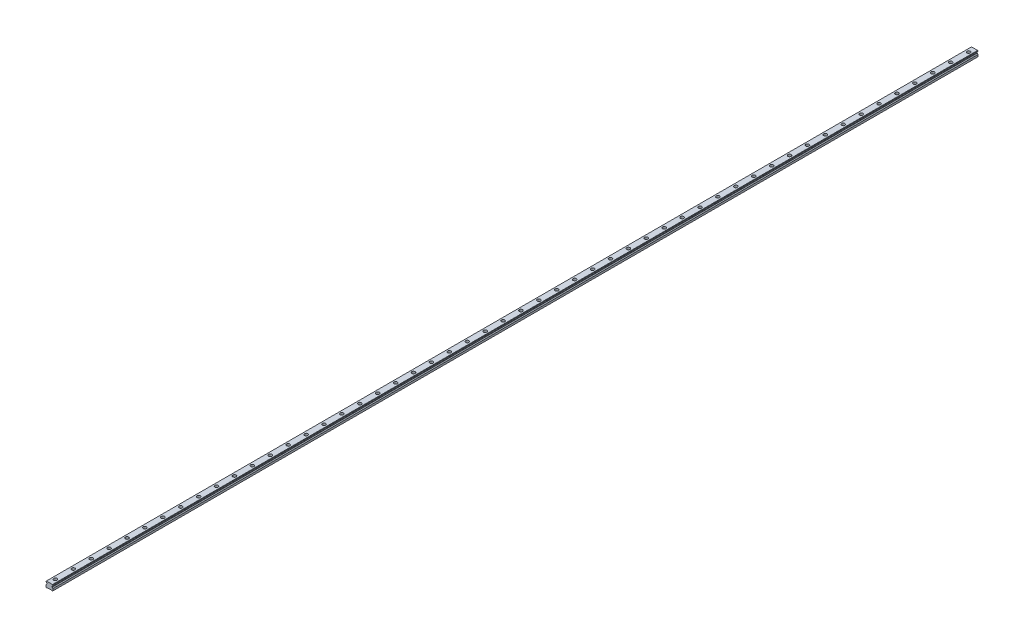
from build123d import *

# Parameters (mm, degrees)
SKETCH1_W           = 23
SKETCH1_H           = 19.2
BOSS_EXTRUDE1_DEPTH = 1550
CUT_EXTRUDE1_DEPTH  = 3101.080787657
CHAMFER1_SIZE       = 1.25
FILLET1_R           = 1.25
CUT_EXTRUDE2_DEPTH  = 3101.080787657
SKETCH4_R           = 5.5
SKETCH4_R_2         = 3.5
CUT_EXTRUDE3_DEPTH  = 9
SKETCH4_2_R         = 3.5
CUT_EXTRUDE4_DEPTH  = 1551.161568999
LPATTERN1_COUNT     = 52
LPATTERN1_PITCH     = 60


with BuildPart() as part:
    # Sketch1 → Boss-Extrude1 (new, symmetric)
    with BuildSketch(Plane.XY):
        with Locations((0, 9.6)):
            Rectangle(SKETCH1_W, SKETCH1_H)
    extrude(amount=BOSS_EXTRUDE1_DEPTH, both=True)

    # Sketch2 → Cut-Extrude1 (cut, through all)
    with BuildSketch(Plane.XY.offset(1550)):
        Polygon((-11.5, 16.7), (-11.5, 7.95), (-8.583333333, 10.866666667), (-8.583333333, 13.783333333), align=None)
        Polygon((8.583333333, 13.783333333), (11.5, 16.7), (11.5, 7.95), (8.583333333, 10.866666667), align=None)
    extrude(amount=-CUT_EXTRUDE1_DEPTH, mode=Mode.SUBTRACT)

    # Chamfer1
    chamfer1_edges = [part.edges().sort_by_distance(p)[0] for p in [
        (-11.5, 19.2, 0),
        (11.5, 19.2, 0),
        (11.5, 0, 0),
        (-11.5, 0, 0),
    ]]
    chamfer(chamfer1_edges, length=CHAMFER1_SIZE)

    # Fillet1
    fillet1_edges = [part.edges().sort_by_distance(p)[0] for p in [
        (-8.583333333, 13.783333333, 0),
        (-8.583333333, 10.866666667, 0),
        (8.583333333, 10.866666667, 0),
        (8.583333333, 13.783333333, 0),
    ]]
    fillet(fillet1_edges, radius=FILLET1_R)

    # Sketch3 → Cut-Extrude2 (cut, through all)
    with BuildSketch(Plane.XY.offset(1550)):
        Polygon((-7, 0), (-5.75, 1.25), (5.75, 1.25), (7, 0), align=None)
    extrude(amount=-CUT_EXTRUDE2_DEPTH, mode=Mode.SUBTRACT)

    # Sketch4 → Cut-Extrude3 (cut)
    with BuildSketch(Plane(origin=(0, 19.2, 0), x_dir=(1, 0, 0), z_dir=(0, 1, 0))):
        with Locations(Location((0, -1530, 0), (0, 0, 270))):
            Circle(SKETCH4_R)
        with Locations(Location((0, -1530, 0), (0, 0, 270))):
            Circle(SKETCH4_R_2, mode=Mode.SUBTRACT)
    cut_extrude3 = extrude(amount=-CUT_EXTRUDE3_DEPTH, mode=Mode.SUBTRACT)

    # Sketch4_2 → Cut-Extrude4 (cut, through all)
    with BuildSketch(Plane(origin=(0, 19.2, 0), x_dir=(1, 0, 0), z_dir=(0, 1, 0))):
        with Locations(Location((0, -1530, 0), (0, 0, 270))):
            Circle(SKETCH4_2_R)
    cut_extrude4 = extrude(amount=-CUT_EXTRUDE4_DEPTH, mode=Mode.SUBTRACT)

    # LPattern1: Cut-Extrude3, Cut-Extrude4 ×52
    with Locations(*[(0, 0, -i * LPATTERN1_PITCH) for i in range(1, LPATTERN1_COUNT)]):
        add(cut_extrude3, mode=Mode.SUBTRACT)
        add(cut_extrude4, mode=Mode.SUBTRACT)


solid = part.part
